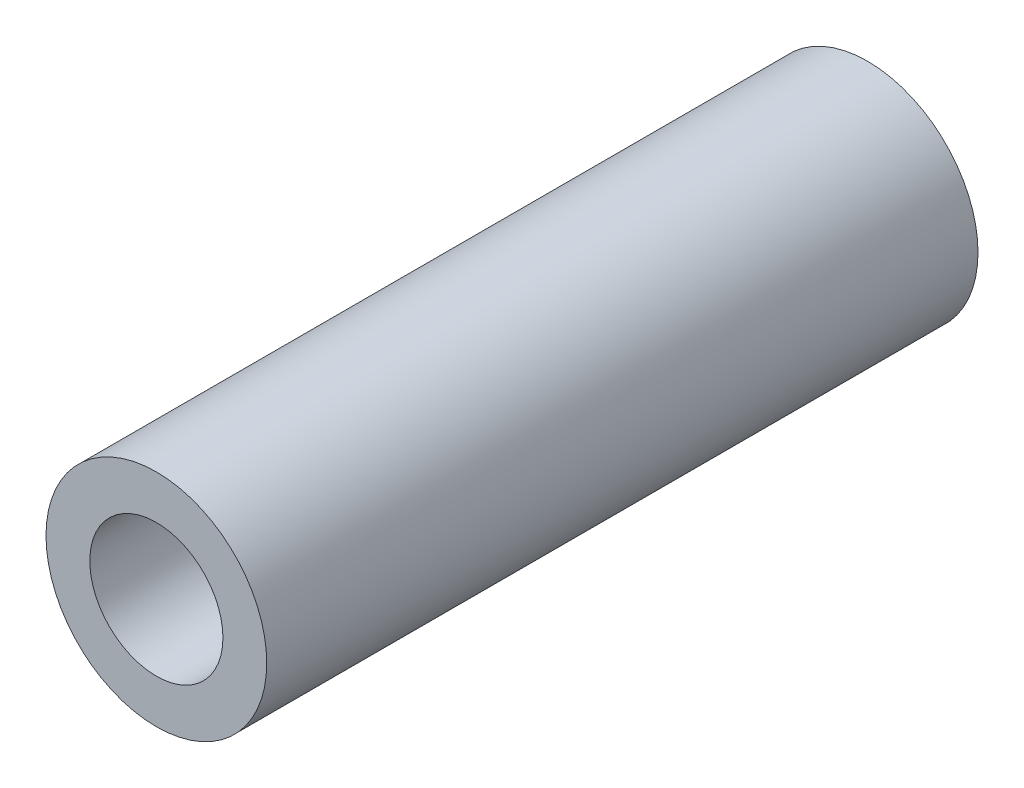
ISO-10303-21;
HEADER;
FILE_DESCRIPTION(('STEP AP214'),'2;1');
FILE_NAME('part.step','',(''),(''),'','','');
FILE_SCHEMA(('AUTOMOTIVE_DESIGN { 1 0 10303 214 1 1 1 1 }'));
ENDSEC;
DATA;
#1=APPLICATION_CONTEXT('core data for automotive mechanical design processes');
#2=APPLICATION_PROTOCOL_DEFINITION('international standard','automotive_design',2000,#1);
#3=PRODUCT_CONTEXT('',#1,'mechanical');
#4=PRODUCT('Part','Part','',(#3));
#5=PRODUCT_RELATED_PRODUCT_CATEGORY('part','',(#4));
#6=PRODUCT_DEFINITION_FORMATION('','',#4);
#7=PRODUCT_DEFINITION_CONTEXT('part definition',#1,'design');
#8=PRODUCT_DEFINITION('design','',#6,#7);
#9=PRODUCT_DEFINITION_SHAPE('','',#8);
#10=(LENGTH_UNIT() NAMED_UNIT(*) SI_UNIT(.MILLI.,.METRE.));
#11=(NAMED_UNIT(*) PLANE_ANGLE_UNIT() SI_UNIT($,.RADIAN.));
#12=(NAMED_UNIT(*) SI_UNIT($,.STERADIAN.) SOLID_ANGLE_UNIT());
#13=UNCERTAINTY_MEASURE_WITH_UNIT(LENGTH_MEASURE(1.E-05),#10,'distance_accuracy_value','');
#14=(GEOMETRIC_REPRESENTATION_CONTEXT(3) GLOBAL_UNCERTAINTY_ASSIGNED_CONTEXT((#13)) GLOBAL_UNIT_ASSIGNED_CONTEXT((#10,
#11,#12)) REPRESENTATION_CONTEXT('',''));
#15=CARTESIAN_POINT('',(0.,0.,0.));
#16=DIRECTION('',(0.,0.,1.));
#17=DIRECTION('',(1.,0.,0.));
#18=AXIS2_PLACEMENT_3D('',#15,#16,#17);
#19=CARTESIAN_POINT('',(0.,0.,203.));
#20=DIRECTION('',(0.,0.,1.));
#21=DIRECTION('',(1.,0.,0.));
#22=AXIS2_PLACEMENT_3D('',#19,#20,#21);
#23=PLANE('',#22);
#24=CARTESIAN_POINT('',(0.,0.,203.));
#25=DIRECTION('',(0.,0.,1.));
#26=DIRECTION('',(1.,0.,0.));
#27=AXIS2_PLACEMENT_3D('',#24,#25,#26);
#28=CIRCLE('',#27,31.5);
#29=CARTESIAN_POINT('',(31.5,0.,203.));
#30=VERTEX_POINT('',#29);
#31=EDGE_CURVE('E9',#30,#30,#28,.T.);
#32=ORIENTED_EDGE('',*,*,#31,.T.);
#33=EDGE_LOOP('',(#32));
#34=FACE_BOUND('',#33,.T.);
#35=CARTESIAN_POINT('',(0.,0.,203.));
#36=DIRECTION('',(0.,0.,1.));
#37=DIRECTION('',(1.,0.,0.));
#38=AXIS2_PLACEMENT_3D('',#35,#36,#37);
#39=CIRCLE('',#38,19.);
#40=CARTESIAN_POINT('',(19.,0.,203.));
#41=VERTEX_POINT('',#40);
#42=EDGE_CURVE('E25',#41,#41,#39,.T.);
#43=ORIENTED_EDGE('',*,*,#42,.F.);
#44=EDGE_LOOP('',(#43));
#45=FACE_BOUND('',#44,.T.);
#46=ADVANCED_FACE('F14',(#34,#45),#23,.T.);
#47=CARTESIAN_POINT('',(0.,0.,0.));
#48=DIRECTION('',(0.,0.,1.));
#49=DIRECTION('',(1.,0.,0.));
#50=AXIS2_PLACEMENT_3D('',#47,#48,#49);
#51=PLANE('',#50);
#52=CARTESIAN_POINT('',(0.,0.,0.));
#53=DIRECTION('',(0.,0.,1.));
#54=DIRECTION('',(1.,0.,0.));
#55=AXIS2_PLACEMENT_3D('',#52,#53,#54);
#56=CIRCLE('',#55,31.5);
#57=CARTESIAN_POINT('',(31.5,0.,0.));
#58=VERTEX_POINT('',#57);
#59=EDGE_CURVE('E18',#58,#58,#56,.T.);
#60=ORIENTED_EDGE('',*,*,#59,.F.);
#61=EDGE_LOOP('',(#60));
#62=FACE_BOUND('',#61,.T.);
#63=CARTESIAN_POINT('',(0.,0.,0.));
#64=DIRECTION('',(0.,0.,1.));
#65=DIRECTION('',(1.,0.,0.));
#66=AXIS2_PLACEMENT_3D('',#63,#64,#65);
#67=CIRCLE('',#66,19.);
#68=CARTESIAN_POINT('',(19.,0.,0.));
#69=VERTEX_POINT('',#68);
#70=EDGE_CURVE('E27',#69,#69,#67,.T.);
#71=ORIENTED_EDGE('',*,*,#70,.T.);
#72=EDGE_LOOP('',(#71));
#73=FACE_BOUND('',#72,.T.);
#74=ADVANCED_FACE('F37',(#62,#73),#51,.F.);
#75=CARTESIAN_POINT('',(0.,0.,203.));
#76=DIRECTION('',(0.,0.,-1.));
#77=DIRECTION('',(-1.,0.,0.));
#78=AXIS2_PLACEMENT_3D('',#75,#76,#77);
#79=CYLINDRICAL_SURFACE('',#78,31.5);
#80=ORIENTED_EDGE('',*,*,#31,.F.);
#81=EDGE_LOOP('',(#80));
#82=FACE_BOUND('',#81,.T.);
#83=ORIENTED_EDGE('',*,*,#59,.T.);
#84=EDGE_LOOP('',(#83));
#85=FACE_BOUND('',#84,.T.);
#86=ADVANCED_FACE('F16',(#82,#85),#79,.T.);
#87=CARTESIAN_POINT('',(0.,0.,203.));
#88=DIRECTION('',(0.,0.,-1.));
#89=DIRECTION('',(-1.,0.,0.));
#90=AXIS2_PLACEMENT_3D('',#87,#88,#89);
#91=CYLINDRICAL_SURFACE('',#90,19.);
#92=ORIENTED_EDGE('',*,*,#42,.T.);
#93=EDGE_LOOP('',(#92));
#94=FACE_BOUND('',#93,.T.);
#95=ORIENTED_EDGE('',*,*,#70,.F.);
#96=EDGE_LOOP('',(#95));
#97=FACE_BOUND('',#96,.T.);
#98=ADVANCED_FACE('F33',(#94,#97),#91,.F.);
#99=CLOSED_SHELL('',(#46,#74,#86,#98));
#100=MANIFOLD_SOLID_BREP('B1',#99);
#101=ADVANCED_BREP_SHAPE_REPRESENTATION('',(#18,#100),#14);
#102=SHAPE_DEFINITION_REPRESENTATION(#9,#101);
ENDSEC;
END-ISO-10303-21;
